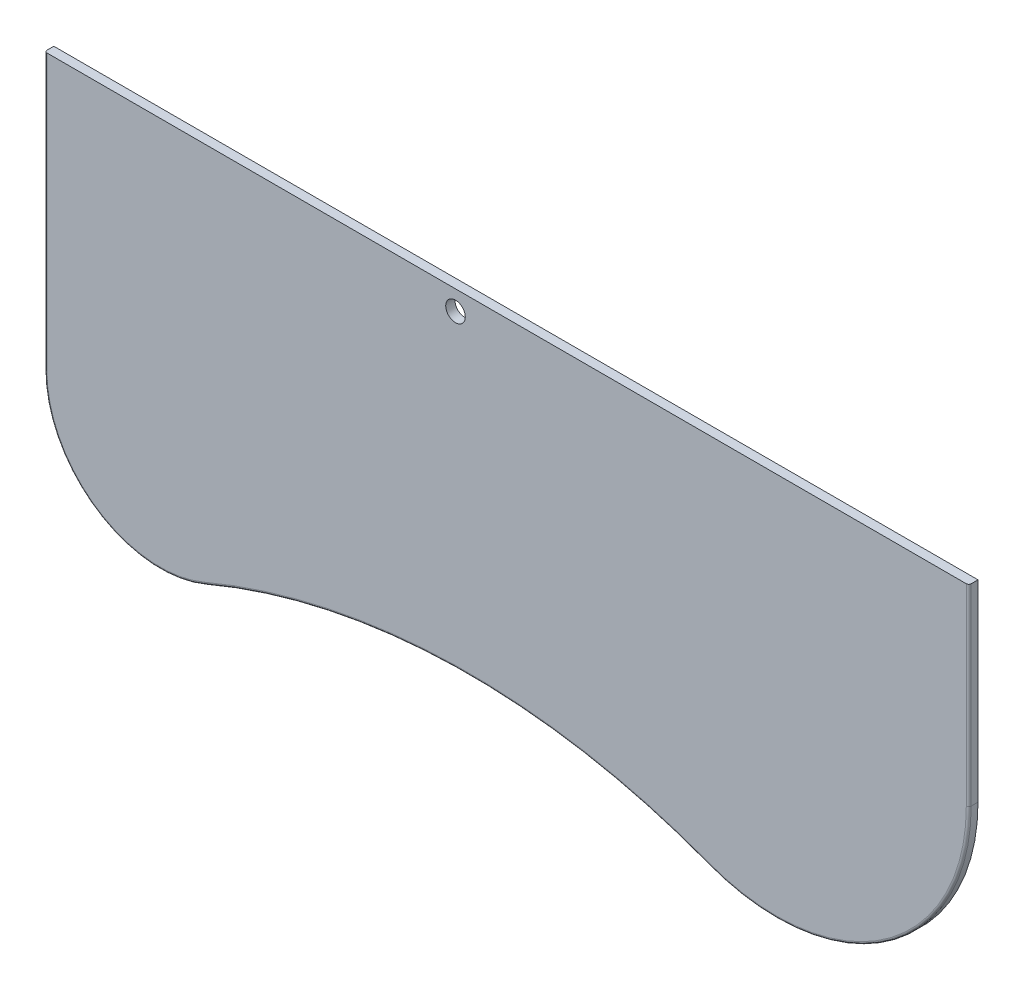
from build123d import *

# Parameters (mm, degrees)
BOSS_EXTRUDE1_DEPTH = 12
FILLET1_R           = 3.175
SKETCH2_R           = 12.7
CUT_EXTRUDE1_DEPTH  = 1304.064941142


with BuildPart() as part:
    # Sketch1 → Boss-Extrude1 (new body)
    with BuildSketch(Plane.XY):
        with BuildLine():
            Line((0, 0), (0, -357.773808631))
            ThreePointArc((0, -357.773808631), (67.201988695, -482.851741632), (208.593190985, -495.856530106))
            ThreePointArc((208.593190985, -495.856530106), (533.629515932, -426.571070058), (861.032801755, -483.633982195))
            ThreePointArc((861.032801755, -483.633982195), (1091.877060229, -455.841929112), (1200, -250))
            Line((1200, -250), (1200, 0))
            Line((1200, 0), (0, 0))
        make_face()
    extrude(amount=-BOSS_EXTRUDE1_DEPTH)

    # Fillet1
    fillet1_edges = [part.edges().sort_by_distance(p)[0] for p in [
        (1200, -125, 0),
        (1091.877060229, -455.841929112, 0),
        (533.629515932, -426.571070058, 0),
        (67.201988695, -482.851741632, 0),
        (0, -178.886904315, 0),
    ]]
    fillet(fillet1_edges, radius=FILLET1_R)

    # Sketch2 → Cut-Extrude1 (cut, through all)
    with BuildSketch(Plane.XY):
        with Locations((533.570047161, -25.4)):
            Circle(SKETCH2_R)
    extrude(amount=-CUT_EXTRUDE1_DEPTH, mode=Mode.SUBTRACT)


solid = part.part
